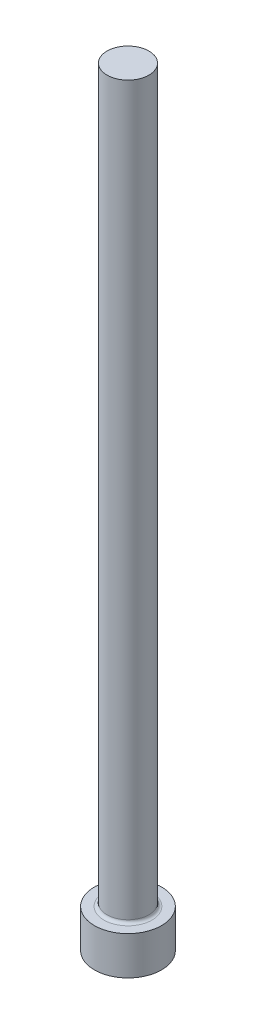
from build123d import *


with BuildPart() as part:
    # Sketch1 → Revolve3 (revolve)
    with BuildSketch(Plane.XY, mode=Mode.PRIVATE) as revolve3_sk:
        with BuildLine():
            Line((0, 0), (2.7686, 0))
            Line((2.7686, 0), (2.7686, 3.175))
            Line((2.7686, 3.175), (1.9812, 3.175))
            ThreePointArc((1.9812, 3.175), (1.801594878, 3.249394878), (1.7272, 3.429))
            Line((1.7272, 3.429), (1.7272, 63.5))
            Line((1.7272, 63.5), (0, 63.5))
            Line((0, 63.5), (0, 0))
        make_face()
    revolve(revolve3_sk.sketch.rotate(Axis((0, 0, 0), (0, -1, 0)), 90), axis=Axis((0, 0, 0), (0, -1, 0)))


solid = part.part
